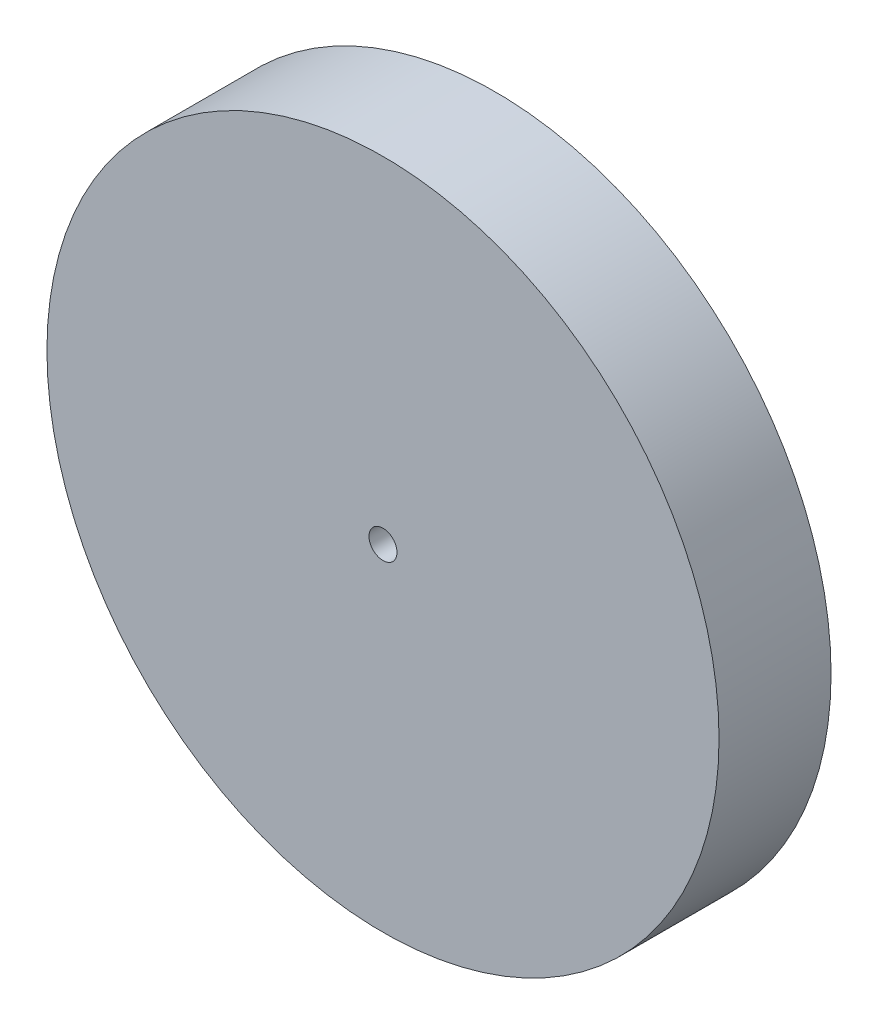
from build123d import *

# Parameters (mm, degrees)
SKETCH1_R           = 38.1
BOSS_EXTRUDE1_DEPTH = 6.35
SKETCH2_R           = 1.5875
CUT_EXTRUDE1_DEPTH  = 12.7


with BuildPart() as part:
    # Sketch1 → Boss-Extrude1 (new, symmetric)
    with BuildSketch(Plane.XY):
        Circle(SKETCH1_R)
    extrude(amount=BOSS_EXTRUDE1_DEPTH, both=True)

    # Sketch2 → Cut-Extrude1 (cut, symmetric)
    with BuildSketch(Plane.XY):
        Circle(SKETCH2_R)
    extrude(amount=CUT_EXTRUDE1_DEPTH, both=True, mode=Mode.SUBTRACT)


solid = part.part
